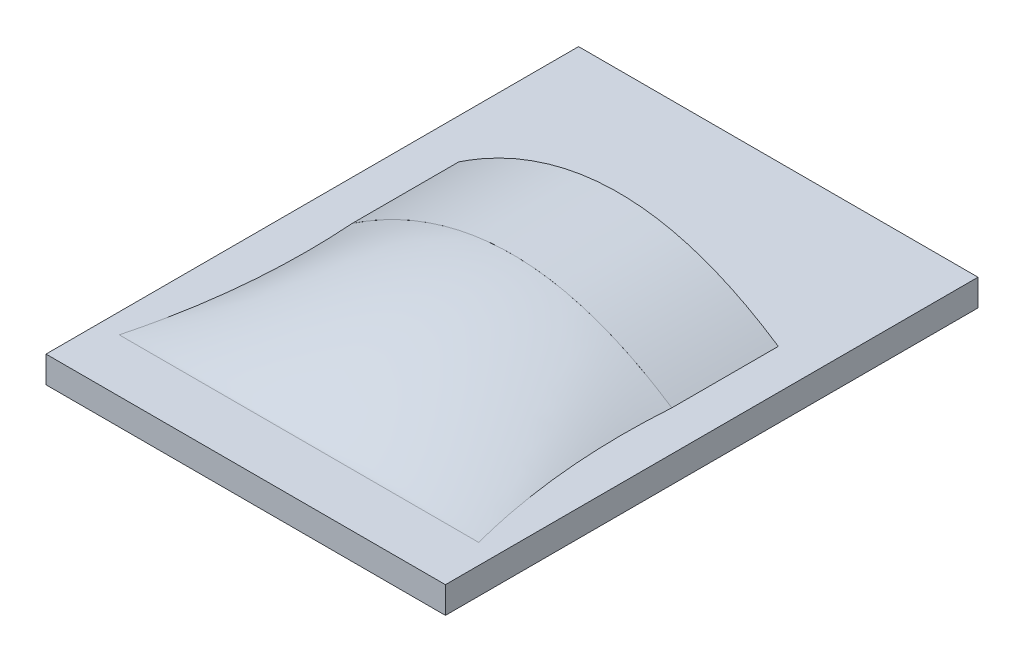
ISO-10303-21;
HEADER;
FILE_DESCRIPTION(('STEP AP214'),'2;1');
FILE_NAME('part.step','',(''),(''),'','','');
FILE_SCHEMA(('AUTOMOTIVE_DESIGN { 1 0 10303 214 1 1 1 1 }'));
ENDSEC;
DATA;
#1=APPLICATION_CONTEXT('core data for automotive mechanical design processes');
#2=APPLICATION_PROTOCOL_DEFINITION('international standard','automotive_design',2000,#1);
#3=PRODUCT_CONTEXT('',#1,'mechanical');
#4=PRODUCT('Part','Part','',(#3));
#5=PRODUCT_RELATED_PRODUCT_CATEGORY('part','',(#4));
#6=PRODUCT_DEFINITION_FORMATION('','',#4);
#7=PRODUCT_DEFINITION_CONTEXT('part definition',#1,'design');
#8=PRODUCT_DEFINITION('design','',#6,#7);
#9=PRODUCT_DEFINITION_SHAPE('','',#8);
#10=(LENGTH_UNIT() NAMED_UNIT(*) SI_UNIT(.MILLI.,.METRE.));
#11=(NAMED_UNIT(*) PLANE_ANGLE_UNIT() SI_UNIT($,.RADIAN.));
#12=(NAMED_UNIT(*) SI_UNIT($,.STERADIAN.) SOLID_ANGLE_UNIT());
#13=UNCERTAINTY_MEASURE_WITH_UNIT(LENGTH_MEASURE(1.E-05),#10,'distance_accuracy_value','');
#14=(GEOMETRIC_REPRESENTATION_CONTEXT(3) GLOBAL_UNCERTAINTY_ASSIGNED_CONTEXT((#13)) GLOBAL_UNIT_ASSIGNED_CONTEXT((#10,
#11,#12)) REPRESENTATION_CONTEXT('',''));
#15=CARTESIAN_POINT('',(0.,0.,0.));
#16=DIRECTION('',(0.,0.,1.));
#17=DIRECTION('',(1.,0.,0.));
#18=AXIS2_PLACEMENT_3D('',#15,#16,#17);
#19=CARTESIAN_POINT('',(-60.0000000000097,3.92741394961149E-12,0.));
#20=CARTESIAN_POINT('',(-58.0820118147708,0.,27.0323105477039));
#21=CARTESIAN_POINT('',(-60.5820118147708,0.,53.6989772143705));
#22=CARTESIAN_POINT('',(-67.5,0.,80.));
#23=CARTESIAN_POINT('',(-57.5000000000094,1.66666666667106,0.));
#24=CARTESIAN_POINT('',(-55.7800310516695,1.95056399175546,27.0578200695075));
#25=CARTESIAN_POINT('',(-58.0697411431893,0.972819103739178,53.7154997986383));
#26=CARTESIAN_POINT('',(-64.6875,0.,80.));
#27=CARTESIAN_POINT('',(-37.5000000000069,14.1666666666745,0.));
#28=CARTESIAN_POINT('',(-37.3692440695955,16.7269491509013,27.2422442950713));
#29=CARTESIAN_POINT('',(-38.041116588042,8.3387052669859,53.8347827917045));
#30=CARTESIAN_POINT('',(-42.1875,0.,80.));
#31=CARTESIAN_POINT('',(2.49999999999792,25.833333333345,0.));
#32=CARTESIAN_POINT('',(2.90155306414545,24.6823386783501,27.9543285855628));
#33=CARTESIAN_POINT('',(2.73786346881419,12.3505185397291,54.1585258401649));
#34=CARTESIAN_POINT('',(2.8125,0.,80.));
#35=CARTESIAN_POINT('',(40.0000000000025,13.3333333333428,0.));
#36=CARTESIAN_POINT('',(38.8922403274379,12.9338744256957,27.2787419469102));
#37=CARTESIAN_POINT('',(40.0994863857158,6.46974557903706,53.7915279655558));
#38=CARTESIAN_POINT('',(45.,0.,80.));
#39=CARTESIAN_POINT('',(60.0000000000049,6.66133814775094E-12,0.));
#40=CARTESIAN_POINT('',(58.0820118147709,0.,27.0323105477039));
#41=CARTESIAN_POINT('',(60.5820118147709,0.,53.6989772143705));
#42=CARTESIAN_POINT('',(67.5,0.,80.));
#43=B_SPLINE_SURFACE_WITH_KNOTS('',3,3,((#19,#20,#21,#22),(#23,#24,#25,#26),(#27,#28,#29,#30),
(#31,#32,#33,#34),(#35,#36,#37,#38),(#39,#40,#41,#42)),.UNSPECIFIED.,.F.,.F.,.F.,(4,1,1,4),(4,
4),(0.,0.0625,0.5,1.),(0.,1.),.UNSPECIFIED.);
#44=CARTESIAN_POINT('',(-60.0000000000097,3.92741394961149E-12,0.));
#45=CARTESIAN_POINT('',(-57.5000000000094,1.66666666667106,0.));
#46=CARTESIAN_POINT('',(-37.5000000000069,14.1666666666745,0.));
#47=CARTESIAN_POINT('',(2.49999999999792,25.833333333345,0.));
#48=CARTESIAN_POINT('',(40.0000000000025,13.3333333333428,0.));
#49=CARTESIAN_POINT('',(60.0000000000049,6.66133814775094E-12,0.));
#50=B_SPLINE_CURVE_WITH_KNOTS('',3,(#44,#45,#46,#47,#48,#49),.UNSPECIFIED.,.F.,.F.,(4,1,1,4),
(0.,0.0625,0.5,1.),.UNSPECIFIED.);
#51=CARTESIAN_POINT('',(-60.0000000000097,3.92741394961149E-12,0.));
#52=VERTEX_POINT('',#51);
#53=CARTESIAN_POINT('',(60.0000000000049,6.66133814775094E-12,0.));
#54=VERTEX_POINT('',#53);
#55=EDGE_CURVE('E14',#52,#54,#50,.T.);
#56=CARTESIAN_POINT('',(60.0000000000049,6.66133814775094E-12,0.));
#57=CARTESIAN_POINT('',(58.0820118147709,0.,27.0323105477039));
#58=CARTESIAN_POINT('',(60.5820118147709,0.,53.6989772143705));
#59=CARTESIAN_POINT('',(67.5,0.,80.));
#60=B_SPLINE_CURVE_WITH_KNOTS('',3,(#56,#57,#58,#59),.UNSPECIFIED.,.F.,.F.,(4,4),(0.,1.),.UNSPECIFIED.);
#61=CARTESIAN_POINT('',(67.5,0.,80.));
#62=VERTEX_POINT('',#61);
#63=EDGE_CURVE('E93',#54,#62,#60,.T.);
#64=DIRECTION('',(-1.,0.,0.));
#65=VECTOR('',#64,1.);
#66=CARTESIAN_POINT('',(0.,0.,80.));
#67=LINE('',#66,#65);
#68=CARTESIAN_POINT('',(-67.5,0.,80.));
#69=VERTEX_POINT('',#68);
#70=EDGE_CURVE('E87',#62,#69,#67,.T.);
#71=CARTESIAN_POINT('',(-60.0000000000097,3.92741394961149E-12,0.));
#72=CARTESIAN_POINT('',(-58.0820118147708,0.,27.0323105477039));
#73=CARTESIAN_POINT('',(-60.5820118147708,0.,53.6989772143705));
#74=CARTESIAN_POINT('',(-67.5,0.,80.));
#75=B_SPLINE_CURVE_WITH_KNOTS('',3,(#71,#72,#73,#74),.UNSPECIFIED.,.F.,.F.,(4,4),(0.,1.),.UNSPECIFIED.);
#76=EDGE_CURVE('E106',#69,#52,#75,.F.);
#77=ORIENTED_EDGE('',*,*,#55,.T.);
#78=ORIENTED_EDGE('',*,*,#63,.T.);
#79=ORIENTED_EDGE('',*,*,#70,.T.);
#80=ORIENTED_EDGE('',*,*,#76,.T.);
#81=EDGE_LOOP('',(#77,#78,#79,#80));
#82=FACE_BOUND('',#81,.T.);
#83=ADVANCED_FACE('F84',(#82),#43,.T.);
#84=OPEN_SHELL('',(#83));
#85=SHELL_BASED_SURFACE_MODEL('B2',(#84));
#86=CARTESIAN_POINT('',(75.,0.,100.));
#87=DIRECTION('',(0.,1.,0.));
#88=DIRECTION('',(0.,0.,1.));
#89=AXIS2_PLACEMENT_3D('',#86,#87,#88);
#90=PLANE('',#89);
#91=DIRECTION('',(0.,0.,-1.));
#92=VECTOR('',#91,1.);
#93=CARTESIAN_POINT('',(75.,0.,-100.));
#94=LINE('',#93,#92);
#95=CARTESIAN_POINT('',(75.,0.,100.));
#96=VERTEX_POINT('',#95);
#97=CARTESIAN_POINT('',(75.,0.,-100.));
#98=VERTEX_POINT('',#97);
#99=EDGE_CURVE('E208',#96,#98,#94,.T.);
#100=ORIENTED_EDGE('',*,*,#99,.T.);
#101=DIRECTION('',(-1.,0.,0.));
#102=VECTOR('',#101,1.);
#103=CARTESIAN_POINT('',(-75.,0.,-100.));
#104=LINE('',#103,#102);
#105=CARTESIAN_POINT('',(-75.,0.,-100.));
#106=VERTEX_POINT('',#105);
#107=EDGE_CURVE('E239',#98,#106,#104,.T.);
#108=ORIENTED_EDGE('',*,*,#107,.T.);
#109=DIRECTION('',(0.,0.,1.));
#110=VECTOR('',#109,1.);
#111=CARTESIAN_POINT('',(-75.,0.,-100.));
#112=LINE('',#111,#110);
#113=CARTESIAN_POINT('',(-75.,0.,100.));
#114=VERTEX_POINT('',#113);
#115=EDGE_CURVE('E242',#106,#114,#112,.T.);
#116=ORIENTED_EDGE('',*,*,#115,.T.);
#117=DIRECTION('',(1.,0.,0.));
#118=VECTOR('',#117,1.);
#119=CARTESIAN_POINT('',(-75.,0.,100.));
#120=LINE('',#119,#118);
#121=EDGE_CURVE('E228',#114,#96,#120,.T.);
#122=ORIENTED_EDGE('',*,*,#121,.T.);
#123=EDGE_LOOP('',(#100,#108,#116,#122));
#124=FACE_BOUND('',#123,.T.);
#125=DIRECTION('',(0.,0.,1.));
#126=VECTOR('',#125,1.);
#127=CARTESIAN_POINT('',(-60.,0.,-40.));
#128=LINE('',#127,#126);
#129=CARTESIAN_POINT('',(-60.0000000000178,-1.33226762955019E-12,-40.));
#130=VERTEX_POINT('',#129);
#131=CARTESIAN_POINT('',(-60.0000000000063,0.,0.));
#132=VERTEX_POINT('',#131);
#133=EDGE_CURVE('E174',#130,#132,#128,.T.);
#134=ORIENTED_EDGE('',*,*,#133,.F.);
#135=DIRECTION('',(1.,0.,0.));
#136=VECTOR('',#135,1.);
#137=CARTESIAN_POINT('',(-60.,0.,-40.));
#138=LINE('',#137,#136);
#139=CARTESIAN_POINT('',(60.0000000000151,-4.44089209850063E-13,-40.));
#140=VERTEX_POINT('',#139);
#141=EDGE_CURVE('E169',#130,#140,#138,.T.);
#142=ORIENTED_EDGE('',*,*,#141,.T.);
#143=DIRECTION('',(0.,0.,1.));
#144=VECTOR('',#143,1.);
#145=CARTESIAN_POINT('',(60.,0.,-40.));
#146=LINE('',#145,#144);
#147=CARTESIAN_POINT('',(60.,0.,0.));
#148=VERTEX_POINT('',#147);
#149=EDGE_CURVE('E202',#140,#148,#146,.T.);
#150=ORIENTED_EDGE('',*,*,#149,.T.);
#151=DIRECTION('',(1.,0.,0.));
#152=VECTOR('',#151,1.);
#153=CARTESIAN_POINT('',(-60.,0.,0.));
#154=LINE('',#153,#152);
#155=EDGE_CURVE('E205',#132,#148,#154,.T.);
#156=ORIENTED_EDGE('',*,*,#155,.F.);
#157=EDGE_LOOP('',(#134,#142,#150,#156));
#158=FACE_BOUND('',#157,.T.);
#159=ADVANCED_FACE('F152',(#124,#158),#90,.T.);
#160=CARTESIAN_POINT('',(75.,-10.,-100.));
#161=DIRECTION('',(1.,0.,0.));
#162=DIRECTION('',(0.,0.,-1.));
#163=AXIS2_PLACEMENT_3D('',#160,#161,#162);
#164=PLANE('',#163);
#165=ORIENTED_EDGE('',*,*,#99,.F.);
#166=DIRECTION('',(0.,1.,0.));
#167=VECTOR('',#166,1.);
#168=CARTESIAN_POINT('',(75.,-10.,100.));
#169=LINE('',#168,#167);
#170=CARTESIAN_POINT('',(75.,-10.,100.));
#171=VERTEX_POINT('',#170);
#172=EDGE_CURVE('E82',#171,#96,#169,.T.);
#173=ORIENTED_EDGE('',*,*,#172,.F.);
#174=DIRECTION('',(0.,0.,-1.));
#175=VECTOR('',#174,1.);
#176=CARTESIAN_POINT('',(75.,-10.,-100.));
#177=LINE('',#176,#175);
#178=CARTESIAN_POINT('',(75.,-10.,-100.));
#179=VERTEX_POINT('',#178);
#180=EDGE_CURVE('E224',#171,#179,#177,.T.);
#181=ORIENTED_EDGE('',*,*,#180,.T.);
#182=DIRECTION('',(0.,1.,0.));
#183=VECTOR('',#182,1.);
#184=CARTESIAN_POINT('',(75.,-10.,-100.));
#185=LINE('',#184,#183);
#186=EDGE_CURVE('E156',#179,#98,#185,.T.);
#187=ORIENTED_EDGE('',*,*,#186,.T.);
#188=EDGE_LOOP('',(#165,#173,#181,#187));
#189=FACE_BOUND('',#188,.T.);
#190=ADVANCED_FACE('F154',(#189),#164,.T.);
#191=CARTESIAN_POINT('',(-75.,-10.,100.));
#192=DIRECTION('',(0.,0.,1.));
#193=DIRECTION('',(1.,0.,0.));
#194=AXIS2_PLACEMENT_3D('',#191,#192,#193);
#195=PLANE('',#194);
#196=ORIENTED_EDGE('',*,*,#121,.F.);
#197=DIRECTION('',(0.,1.,0.));
#198=VECTOR('',#197,1.);
#199=CARTESIAN_POINT('',(-75.,-10.,100.));
#200=LINE('',#199,#198);
#201=CARTESIAN_POINT('',(-75.,-10.,100.));
#202=VERTEX_POINT('',#201);
#203=EDGE_CURVE('E161',#202,#114,#200,.T.);
#204=ORIENTED_EDGE('',*,*,#203,.F.);
#205=DIRECTION('',(1.,0.,0.));
#206=VECTOR('',#205,1.);
#207=CARTESIAN_POINT('',(-75.,-10.,100.));
#208=LINE('',#207,#206);
#209=EDGE_CURVE('E234',#202,#171,#208,.T.);
#210=ORIENTED_EDGE('',*,*,#209,.T.);
#211=ORIENTED_EDGE('',*,*,#172,.T.);
#212=EDGE_LOOP('',(#196,#204,#210,#211));
#213=FACE_BOUND('',#212,.T.);
#214=ADVANCED_FACE('F259',(#213),#195,.T.);
#215=CARTESIAN_POINT('',(-75.,-10.,-100.));
#216=DIRECTION('',(-1.,0.,0.));
#217=DIRECTION('',(0.,0.,1.));
#218=AXIS2_PLACEMENT_3D('',#215,#216,#217);
#219=PLANE('',#218);
#220=ORIENTED_EDGE('',*,*,#115,.F.);
#221=DIRECTION('',(0.,1.,0.));
#222=VECTOR('',#221,1.);
#223=CARTESIAN_POINT('',(-75.,-10.,-100.));
#224=LINE('',#223,#222);
#225=CARTESIAN_POINT('',(-75.,-10.,-100.));
#226=VERTEX_POINT('',#225);
#227=EDGE_CURVE('E247',#226,#106,#224,.T.);
#228=ORIENTED_EDGE('',*,*,#227,.F.);
#229=DIRECTION('',(0.,0.,1.));
#230=VECTOR('',#229,1.);
#231=CARTESIAN_POINT('',(-75.,-10.,-100.));
#232=LINE('',#231,#230);
#233=EDGE_CURVE('E231',#226,#202,#232,.T.);
#234=ORIENTED_EDGE('',*,*,#233,.T.);
#235=ORIENTED_EDGE('',*,*,#203,.T.);
#236=EDGE_LOOP('',(#220,#228,#234,#235));
#237=FACE_BOUND('',#236,.T.);
#238=ADVANCED_FACE('F265',(#237),#219,.T.);
#239=CARTESIAN_POINT('',(-75.,-10.,-100.));
#240=DIRECTION('',(0.,0.,-1.));
#241=DIRECTION('',(-1.,0.,0.));
#242=AXIS2_PLACEMENT_3D('',#239,#240,#241);
#243=PLANE('',#242);
#244=ORIENTED_EDGE('',*,*,#107,.F.);
#245=ORIENTED_EDGE('',*,*,#186,.F.);
#246=DIRECTION('',(-1.,0.,0.));
#247=VECTOR('',#246,1.);
#248=CARTESIAN_POINT('',(-75.,-10.,-100.));
#249=LINE('',#248,#247);
#250=EDGE_CURVE('E227',#179,#226,#249,.T.);
#251=ORIENTED_EDGE('',*,*,#250,.T.);
#252=ORIENTED_EDGE('',*,*,#227,.T.);
#253=EDGE_LOOP('',(#244,#245,#251,#252));
#254=FACE_BOUND('',#253,.T.);
#255=ADVANCED_FACE('F255',(#254),#243,.T.);
#256=CARTESIAN_POINT('',(75.,-10.,100.));
#257=DIRECTION('',(0.,1.,0.));
#258=DIRECTION('',(0.,0.,1.));
#259=AXIS2_PLACEMENT_3D('',#256,#257,#258);
#260=PLANE('',#259);
#261=ORIENTED_EDGE('',*,*,#180,.F.);
#262=ORIENTED_EDGE('',*,*,#209,.F.);
#263=ORIENTED_EDGE('',*,*,#233,.F.);
#264=ORIENTED_EDGE('',*,*,#250,.F.);
#265=EDGE_LOOP('',(#261,#262,#263,#264));
#266=FACE_BOUND('',#265,.T.);
#267=ADVANCED_FACE('F262',(#266),#260,.F.);
#268=CARTESIAN_POINT('',(13416.4078649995,-999980.,-40.));
#269=CARTESIAN_POINT('',(-7.8159700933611E-10,1000020.,-40.));
#270=CARTESIAN_POINT('',(-13416.407864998,-999980.,-40.));
#271=B_SPLINE_CURVE_WITH_KNOTS('',2,(#268,#269,#270),.UNSPECIFIED.,.F.,.F.,(3,3),(0.,1.),.UNSPECIFIED.);
#272=DIRECTION('',(0.,0.,1.));
#273=VECTOR('',#272,1.);
#274=SURFACE_OF_LINEAR_EXTRUSION('',#271,#273);
#275=CARTESIAN_POINT('',(13416.4078649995,-999980.,0.));
#276=CARTESIAN_POINT('',(-7.8159700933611E-10,1000020.,0.));
#277=CARTESIAN_POINT('',(-13416.407864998,-999980.,0.));
#278=B_SPLINE_CURVE_WITH_KNOTS('',2,(#275,#276,#277),.UNSPECIFIED.,.F.,.F.,(3,3),(0.,1.),.UNSPECIFIED.);
#279=EDGE_CURVE('E211',#148,#132,#278,.T.);
#280=ORIENTED_EDGE('',*,*,#279,.F.);
#281=ORIENTED_EDGE('',*,*,#149,.F.);
#282=EDGE_CURVE('E216',#140,#130,#271,.T.);
#283=ORIENTED_EDGE('',*,*,#282,.T.);
#284=ORIENTED_EDGE('',*,*,#133,.T.);
#285=EDGE_LOOP('',(#280,#281,#283,#284));
#286=FACE_BOUND('',#285,.T.);
#287=ADVANCED_FACE('F212',(#286),#274,.T.);
#288=CARTESIAN_POINT('',(-8.88178419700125E-13,20.0000000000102,-40.));
#289=DIRECTION('',(0.,0.,1.));
#290=DIRECTION('',(1.,0.,0.));
#291=AXIS2_PLACEMENT_3D('',#288,#289,#290);
#292=PLANE('',#291);
#293=ORIENTED_EDGE('',*,*,#282,.F.);
#294=ORIENTED_EDGE('',*,*,#141,.F.);
#295=EDGE_LOOP('',(#293,#294));
#296=FACE_BOUND('',#295,.T.);
#297=ADVANCED_FACE('F283',(#296),#292,.F.);
#298=CARTESIAN_POINT('',(-8.88178419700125E-13,20.0000000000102,0.));
#299=DIRECTION('',(0.,0.,1.));
#300=DIRECTION('',(1.,0.,0.));
#301=AXIS2_PLACEMENT_3D('',#298,#299,#300);
#302=PLANE('',#301);
#303=ORIENTED_EDGE('',*,*,#279,.T.);
#304=ORIENTED_EDGE('',*,*,#155,.T.);
#305=EDGE_LOOP('',(#303,#304));
#306=FACE_BOUND('',#305,.T.);
#307=ADVANCED_FACE('F215',(#306),#302,.T.);
#308=CLOSED_SHELL('',(#159,#190,#214,#238,#255,#267,#287,#297,#307));
#309=MANIFOLD_SOLID_BREP('B8',#308);
#310=ADVANCED_BREP_SHAPE_REPRESENTATION('',(#18,#309),#14);
#311=MANIFOLD_SURFACE_SHAPE_REPRESENTATION('',(#18,#85),#14);
#312=SHAPE_REPRESENTATION('',(#18),#14);
#313=SHAPE_DEFINITION_REPRESENTATION(#9,#312);
#314=SHAPE_REPRESENTATION_RELATIONSHIP('','',#312,#310);
#315=SHAPE_REPRESENTATION_RELATIONSHIP('','',#312,#311);
ENDSEC;
END-ISO-10303-21;
